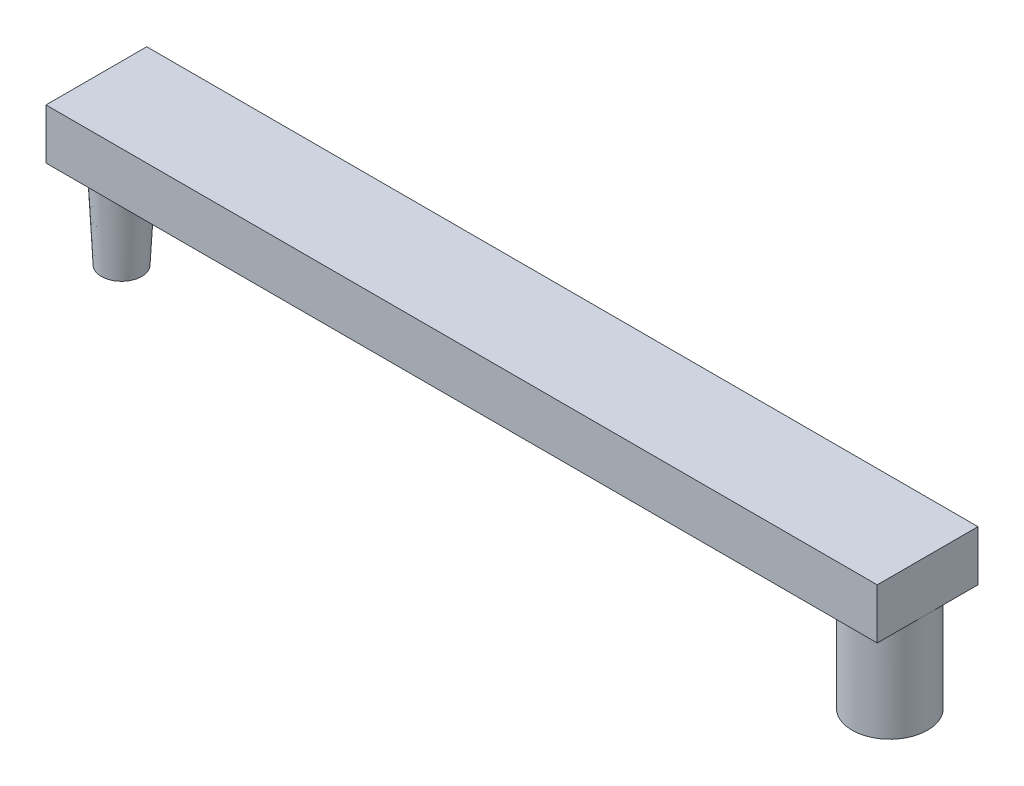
ISO-10303-21;
HEADER;
FILE_DESCRIPTION(('STEP AP214'),'2;1');
FILE_NAME('part.step','',(''),(''),'','','');
FILE_SCHEMA(('AUTOMOTIVE_DESIGN { 1 0 10303 214 1 1 1 1 }'));
ENDSEC;
DATA;
#1=APPLICATION_CONTEXT('core data for automotive mechanical design processes');
#2=APPLICATION_PROTOCOL_DEFINITION('international standard','automotive_design',2000,#1);
#3=PRODUCT_CONTEXT('',#1,'mechanical');
#4=PRODUCT('Part','Part','',(#3));
#5=PRODUCT_RELATED_PRODUCT_CATEGORY('part','',(#4));
#6=PRODUCT_DEFINITION_FORMATION('','',#4);
#7=PRODUCT_DEFINITION_CONTEXT('part definition',#1,'design');
#8=PRODUCT_DEFINITION('design','',#6,#7);
#9=PRODUCT_DEFINITION_SHAPE('','',#8);
#10=(LENGTH_UNIT() NAMED_UNIT(*) SI_UNIT(.MILLI.,.METRE.));
#11=(NAMED_UNIT(*) PLANE_ANGLE_UNIT() SI_UNIT($,.RADIAN.));
#12=(NAMED_UNIT(*) SI_UNIT($,.STERADIAN.) SOLID_ANGLE_UNIT());
#13=UNCERTAINTY_MEASURE_WITH_UNIT(LENGTH_MEASURE(1.E-05),#10,'distance_accuracy_value','');
#14=(GEOMETRIC_REPRESENTATION_CONTEXT(3) GLOBAL_UNCERTAINTY_ASSIGNED_CONTEXT((#13)) GLOBAL_UNIT_ASSIGNED_CONTEXT((#10,
#11,#12)) REPRESENTATION_CONTEXT('',''));
#15=CARTESIAN_POINT('',(0.,0.,0.));
#16=DIRECTION('',(0.,0.,1.));
#17=DIRECTION('',(1.,0.,0.));
#18=AXIS2_PLACEMENT_3D('',#15,#16,#17);
#19=CARTESIAN_POINT('',(8.25,1.,1.));
#20=DIRECTION('',(-1.,0.,0.));
#21=DIRECTION('',(0.,0.,1.));
#22=AXIS2_PLACEMENT_3D('',#19,#20,#21);
#23=PLANE('',#22);
#24=DIRECTION('',(0.,0.,-1.));
#25=VECTOR('',#24,1.);
#26=CARTESIAN_POINT('',(8.25,0.,1.));
#27=LINE('',#26,#25);
#28=CARTESIAN_POINT('',(8.25,0.,1.));
#29=VERTEX_POINT('',#28);
#30=CARTESIAN_POINT('',(8.25,0.,0.));
#31=VERTEX_POINT('',#30);
#32=EDGE_CURVE('E97',#29,#31,#27,.T.);
#33=ORIENTED_EDGE('',*,*,#32,.T.);
#34=CARTESIAN_POINT('',(8.25,0.,-1.));
#35=VERTEX_POINT('',#34);
#36=EDGE_CURVE('E100',#31,#35,#27,.T.);
#37=ORIENTED_EDGE('',*,*,#36,.T.);
#38=DIRECTION('',(0.,-1.,0.));
#39=VECTOR('',#38,1.);
#40=CARTESIAN_POINT('',(8.25,1.,-1.));
#41=LINE('',#40,#39);
#42=CARTESIAN_POINT('',(8.25,1.,-1.));
#43=VERTEX_POINT('',#42);
#44=EDGE_CURVE('E11',#43,#35,#41,.T.);
#45=ORIENTED_EDGE('',*,*,#44,.F.);
#46=DIRECTION('',(0.,0.,-1.));
#47=VECTOR('',#46,1.);
#48=CARTESIAN_POINT('',(8.25,1.,1.));
#49=LINE('',#48,#47);
#50=CARTESIAN_POINT('',(8.25,1.,1.));
#51=VERTEX_POINT('',#50);
#52=EDGE_CURVE('E131',#51,#43,#49,.T.);
#53=ORIENTED_EDGE('',*,*,#52,.F.);
#54=DIRECTION('',(0.,-1.,0.));
#55=VECTOR('',#54,1.);
#56=CARTESIAN_POINT('',(8.25,1.,1.));
#57=LINE('',#56,#55);
#58=EDGE_CURVE('E103',#51,#29,#57,.T.);
#59=ORIENTED_EDGE('',*,*,#58,.T.);
#60=EDGE_LOOP('',(#33,#37,#45,#53,#59));
#61=FACE_BOUND('',#60,.T.);
#62=ADVANCED_FACE('F43',(#61),#23,.F.);
#63=CARTESIAN_POINT('',(-8.25,1.,-1.));
#64=DIRECTION('',(0.,0.,1.));
#65=DIRECTION('',(1.,0.,0.));
#66=AXIS2_PLACEMENT_3D('',#63,#64,#65);
#67=PLANE('',#66);
#68=DIRECTION('',(-1.,0.,0.));
#69=VECTOR('',#68,1.);
#70=CARTESIAN_POINT('',(-8.25,0.,-1.));
#71=LINE('',#70,#69);
#72=CARTESIAN_POINT('',(-8.25,0.,-1.));
#73=VERTEX_POINT('',#72);
#74=EDGE_CURVE('E107',#35,#73,#71,.T.);
#75=ORIENTED_EDGE('',*,*,#74,.T.);
#76=DIRECTION('',(0.,-1.,0.));
#77=VECTOR('',#76,1.);
#78=CARTESIAN_POINT('',(-8.25,1.,-1.));
#79=LINE('',#78,#77);
#80=CARTESIAN_POINT('',(-8.25,1.,-1.));
#81=VERTEX_POINT('',#80);
#82=EDGE_CURVE('E51',#81,#73,#79,.T.);
#83=ORIENTED_EDGE('',*,*,#82,.F.);
#84=DIRECTION('',(-1.,0.,0.));
#85=VECTOR('',#84,1.);
#86=CARTESIAN_POINT('',(-8.25,1.,-1.));
#87=LINE('',#86,#85);
#88=EDGE_CURVE('E92',#43,#81,#87,.T.);
#89=ORIENTED_EDGE('',*,*,#88,.F.);
#90=ORIENTED_EDGE('',*,*,#44,.T.);
#91=EDGE_LOOP('',(#75,#83,#89,#90));
#92=FACE_BOUND('',#91,.T.);
#93=ADVANCED_FACE('F159',(#92),#67,.F.);
#94=CARTESIAN_POINT('',(-8.25,1.,1.));
#95=DIRECTION('',(1.,0.,0.));
#96=DIRECTION('',(0.,0.,-1.));
#97=AXIS2_PLACEMENT_3D('',#94,#95,#96);
#98=PLANE('',#97);
#99=DIRECTION('',(0.,0.,1.));
#100=VECTOR('',#99,1.);
#101=CARTESIAN_POINT('',(-8.25,0.,1.));
#102=LINE('',#101,#100);
#103=CARTESIAN_POINT('',(-8.25,0.,0.));
#104=VERTEX_POINT('',#103);
#105=EDGE_CURVE('E125',#73,#104,#102,.T.);
#106=ORIENTED_EDGE('',*,*,#105,.T.);
#107=CARTESIAN_POINT('',(-8.25,0.,1.));
#108=VERTEX_POINT('',#107);
#109=EDGE_CURVE('E124',#104,#108,#102,.T.);
#110=ORIENTED_EDGE('',*,*,#109,.T.);
#111=DIRECTION('',(0.,-1.,0.));
#112=VECTOR('',#111,1.);
#113=CARTESIAN_POINT('',(-8.25,1.,1.));
#114=LINE('',#113,#112);
#115=CARTESIAN_POINT('',(-8.25,1.,1.));
#116=VERTEX_POINT('',#115);
#117=EDGE_CURVE('E134',#116,#108,#114,.T.);
#118=ORIENTED_EDGE('',*,*,#117,.F.);
#119=DIRECTION('',(0.,0.,1.));
#120=VECTOR('',#119,1.);
#121=CARTESIAN_POINT('',(-8.25,1.,1.));
#122=LINE('',#121,#120);
#123=EDGE_CURVE('E142',#81,#116,#122,.T.);
#124=ORIENTED_EDGE('',*,*,#123,.F.);
#125=ORIENTED_EDGE('',*,*,#82,.T.);
#126=EDGE_LOOP('',(#106,#110,#118,#124,#125));
#127=FACE_BOUND('',#126,.T.);
#128=ADVANCED_FACE('F140',(#127),#98,.F.);
#129=CARTESIAN_POINT('',(-8.25,1.,1.));
#130=DIRECTION('',(0.,0.,-1.));
#131=DIRECTION('',(-1.,0.,0.));
#132=AXIS2_PLACEMENT_3D('',#129,#130,#131);
#133=PLANE('',#132);
#134=DIRECTION('',(1.,0.,0.));
#135=VECTOR('',#134,1.);
#136=CARTESIAN_POINT('',(-8.25,0.,1.));
#137=LINE('',#136,#135);
#138=EDGE_CURVE('E85',#108,#29,#137,.T.);
#139=ORIENTED_EDGE('',*,*,#138,.T.);
#140=ORIENTED_EDGE('',*,*,#58,.F.);
#141=DIRECTION('',(1.,0.,0.));
#142=VECTOR('',#141,1.);
#143=CARTESIAN_POINT('',(-8.25,1.,1.));
#144=LINE('',#143,#142);
#145=EDGE_CURVE('E64',#116,#51,#144,.T.);
#146=ORIENTED_EDGE('',*,*,#145,.F.);
#147=ORIENTED_EDGE('',*,*,#117,.T.);
#148=EDGE_LOOP('',(#139,#140,#146,#147));
#149=FACE_BOUND('',#148,.T.);
#150=ADVANCED_FACE('F158',(#149),#133,.F.);
#151=CARTESIAN_POINT('',(0.,1.,0.));
#152=DIRECTION('',(0.,-1.,0.));
#153=DIRECTION('',(0.,0.,-1.));
#154=AXIS2_PLACEMENT_3D('',#151,#152,#153);
#155=PLANE('',#154);
#156=ORIENTED_EDGE('',*,*,#52,.T.);
#157=ORIENTED_EDGE('',*,*,#88,.T.);
#158=ORIENTED_EDGE('',*,*,#123,.T.);
#159=ORIENTED_EDGE('',*,*,#145,.T.);
#160=EDGE_LOOP('',(#156,#157,#158,#159));
#161=FACE_BOUND('',#160,.T.);
#162=ADVANCED_FACE('F157',(#161),#155,.F.);
#163=CARTESIAN_POINT('',(0.,0.,0.));
#164=DIRECTION('',(0.,-1.,0.));
#165=DIRECTION('',(0.,0.,-1.));
#166=AXIS2_PLACEMENT_3D('',#163,#164,#165);
#167=PLANE('',#166);
#168=ORIENTED_EDGE('',*,*,#109,.F.);
#169=CARTESIAN_POINT('',(-7.75,0.,0.));
#170=DIRECTION('',(0.,1.,0.));
#171=DIRECTION('',(-1.,0.,0.));
#172=AXIS2_PLACEMENT_3D('',#169,#170,#171);
#173=CIRCLE('',#172,0.5);
#174=EDGE_CURVE('E56',#104,#104,#173,.T.);
#175=ORIENTED_EDGE('',*,*,#174,.T.);
#176=ORIENTED_EDGE('',*,*,#105,.F.);
#177=ORIENTED_EDGE('',*,*,#74,.F.);
#178=ORIENTED_EDGE('',*,*,#36,.F.);
#179=CARTESIAN_POINT('',(7.5,0.,0.));
#180=DIRECTION('',(0.,-1.,0.));
#181=DIRECTION('',(0.,0.,-1.));
#182=AXIS2_PLACEMENT_3D('',#179,#180,#181);
#183=CIRCLE('',#182,0.749999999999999);
#184=EDGE_CURVE('E112',#31,#31,#183,.T.);
#185=ORIENTED_EDGE('',*,*,#184,.F.);
#186=ORIENTED_EDGE('',*,*,#32,.F.);
#187=ORIENTED_EDGE('',*,*,#138,.F.);
#188=EDGE_LOOP('',(#168,#175,#176,#177,#178,#185,#186,#187));
#189=FACE_BOUND('',#188,.T.);
#190=ADVANCED_FACE('F110',(#189),#167,.T.);
#191=CARTESIAN_POINT('',(7.5,-2.,0.));
#192=DIRECTION('',(0.,1.,0.));
#193=DIRECTION('',(0.,0.,1.));
#194=AXIS2_PLACEMENT_3D('',#191,#192,#193);
#195=CYLINDRICAL_SURFACE('',#194,0.749999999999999);
#196=CARTESIAN_POINT('',(7.5,-2.,0.));
#197=DIRECTION('',(0.,-1.,0.));
#198=DIRECTION('',(0.,0.,-1.));
#199=AXIS2_PLACEMENT_3D('',#196,#197,#198);
#200=CIRCLE('',#199,0.749999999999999);
#201=CARTESIAN_POINT('',(7.5,-2.,-0.749999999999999));
#202=VERTEX_POINT('',#201);
#203=EDGE_CURVE('E115',#202,#202,#200,.T.);
#204=ORIENTED_EDGE('',*,*,#203,.F.);
#205=EDGE_LOOP('',(#204));
#206=FACE_BOUND('',#205,.T.);
#207=ORIENTED_EDGE('',*,*,#184,.T.);
#208=EDGE_LOOP('',(#207));
#209=FACE_BOUND('',#208,.T.);
#210=ADVANCED_FACE('F171',(#206,#209),#195,.T.);
#211=CARTESIAN_POINT('',(7.5,-2.,0.));
#212=DIRECTION('',(0.,-1.,0.));
#213=DIRECTION('',(0.,0.,-1.));
#214=AXIS2_PLACEMENT_3D('',#211,#212,#213);
#215=PLANE('',#214);
#216=ORIENTED_EDGE('',*,*,#203,.T.);
#217=EDGE_LOOP('',(#216));
#218=FACE_BOUND('',#217,.T.);
#219=ADVANCED_FACE('F176',(#218),#215,.T.);
#220=CARTESIAN_POINT('',(-7.75,-2.,0.));
#221=DIRECTION('',(0.,1.,0.));
#222=DIRECTION('',(-1.,0.,0.));
#223=AXIS2_PLACEMENT_3D('',#220,#221,#222);
#224=CONICAL_SURFACE('',#223,0.400000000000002,0.049958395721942);
#225=ORIENTED_EDGE('',*,*,#174,.F.);
#226=EDGE_LOOP('',(#225));
#227=FACE_BOUND('',#226,.T.);
#228=CARTESIAN_POINT('',(-7.75,-2.,0.));
#229=DIRECTION('',(0.,1.,0.));
#230=DIRECTION('',(-1.,0.,0.));
#231=AXIS2_PLACEMENT_3D('',#228,#229,#230);
#232=CIRCLE('',#231,0.400000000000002);
#233=CARTESIAN_POINT('',(-8.15,-2.,0.));
#234=VERTEX_POINT('',#233);
#235=EDGE_CURVE('E144',#234,#234,#232,.T.);
#236=ORIENTED_EDGE('',*,*,#235,.T.);
#237=EDGE_LOOP('',(#236));
#238=FACE_BOUND('',#237,.T.);
#239=ADVANCED_FACE('F180',(#227,#238),#224,.T.);
#240=CARTESIAN_POINT('',(-7.75,-2.,0.));
#241=DIRECTION('',(0.,-1.,0.));
#242=DIRECTION('',(0.,0.,-1.));
#243=AXIS2_PLACEMENT_3D('',#240,#241,#242);
#244=PLANE('',#243);
#245=ORIENTED_EDGE('',*,*,#235,.F.);
#246=EDGE_LOOP('',(#245));
#247=FACE_BOUND('',#246,.T.);
#248=ADVANCED_FACE('F182',(#247),#244,.T.);
#249=CLOSED_SHELL('',(#62,#93,#128,#150,#162,#190,#210,#219,#239,#248));
#250=MANIFOLD_SOLID_BREP('B2',#249);
#251=ADVANCED_BREP_SHAPE_REPRESENTATION('',(#18,#250),#14);
#252=SHAPE_DEFINITION_REPRESENTATION(#9,#251);
ENDSEC;
END-ISO-10303-21;
